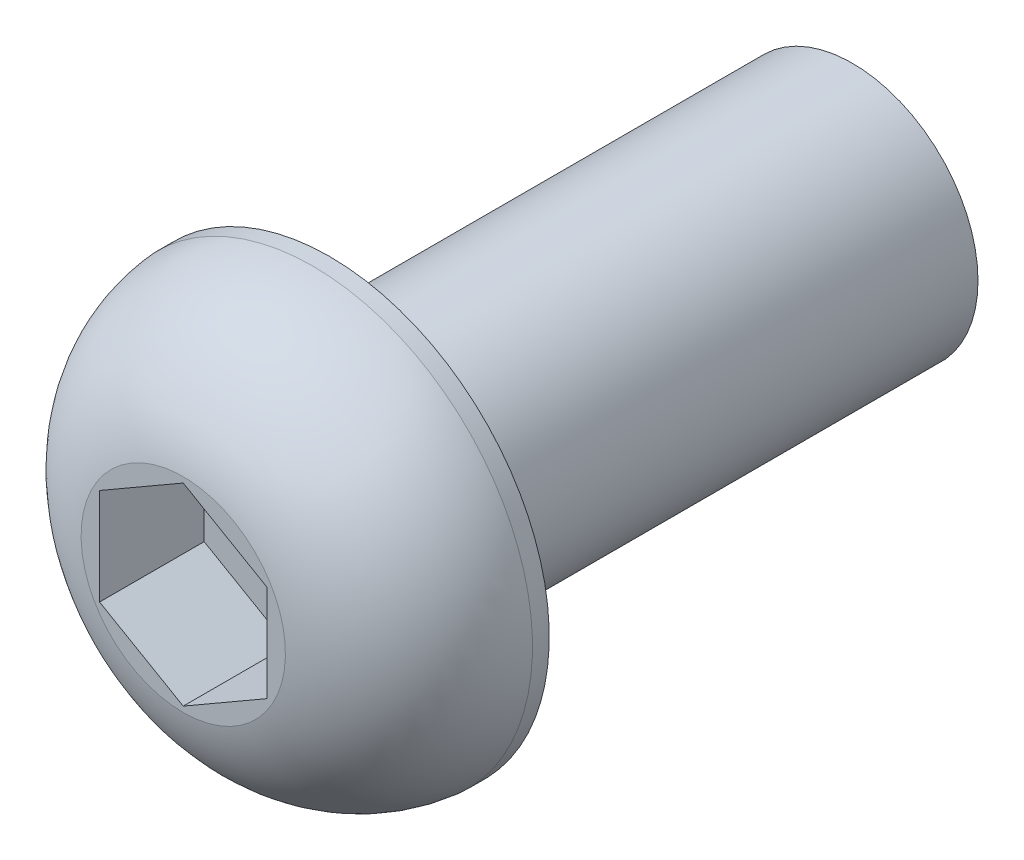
ISO-10303-21;
HEADER;
FILE_DESCRIPTION(('STEP AP214'),'2;1');
FILE_NAME('part.step','',(''),(''),'','','');
FILE_SCHEMA(('AUTOMOTIVE_DESIGN { 1 0 10303 214 1 1 1 1 }'));
ENDSEC;
DATA;
#1=APPLICATION_CONTEXT('core data for automotive mechanical design processes');
#2=APPLICATION_PROTOCOL_DEFINITION('international standard','automotive_design',2000,#1);
#3=PRODUCT_CONTEXT('',#1,'mechanical');
#4=PRODUCT('Part','Part','',(#3));
#5=PRODUCT_RELATED_PRODUCT_CATEGORY('part','',(#4));
#6=PRODUCT_DEFINITION_FORMATION('','',#4);
#7=PRODUCT_DEFINITION_CONTEXT('part definition',#1,'design');
#8=PRODUCT_DEFINITION('design','',#6,#7);
#9=PRODUCT_DEFINITION_SHAPE('','',#8);
#10=(LENGTH_UNIT() NAMED_UNIT(*) SI_UNIT(.MILLI.,.METRE.));
#11=(NAMED_UNIT(*) PLANE_ANGLE_UNIT() SI_UNIT($,.RADIAN.));
#12=(NAMED_UNIT(*) SI_UNIT($,.STERADIAN.) SOLID_ANGLE_UNIT());
#13=UNCERTAINTY_MEASURE_WITH_UNIT(LENGTH_MEASURE(1.E-05),#10,'distance_accuracy_value','');
#14=(GEOMETRIC_REPRESENTATION_CONTEXT(3) GLOBAL_UNCERTAINTY_ASSIGNED_CONTEXT((#13)) GLOBAL_UNIT_ASSIGNED_CONTEXT((#10,
#11,#12)) REPRESENTATION_CONTEXT('',''));
#15=CARTESIAN_POINT('',(0.,0.,0.));
#16=DIRECTION('',(0.,0.,1.));
#17=DIRECTION('',(1.,0.,0.));
#18=AXIS2_PLACEMENT_3D('',#15,#16,#17);
#19=CARTESIAN_POINT('',(0.,0.,7.));
#20=DIRECTION('',(0.,0.,1.));
#21=DIRECTION('',(0.,-1.,0.));
#22=AXIS2_PLACEMENT_3D('',#19,#20,#21);
#23=PLANE('',#22);
#24=CARTESIAN_POINT('',(0.,0.,7.));
#25=DIRECTION('',(0.,0.,1.));
#26=DIRECTION('',(0.,-1.,0.));
#27=AXIS2_PLACEMENT_3D('',#24,#25,#26);
#28=CIRCLE('',#27,4.88468858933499);
#29=CARTESIAN_POINT('',(0.,-4.88468858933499,7.));
#30=VERTEX_POINT('',#29);
#31=EDGE_CURVE('E72',#30,#30,#28,.T.);
#32=ORIENTED_EDGE('',*,*,#31,.T.);
#33=EDGE_LOOP('',(#32));
#34=FACE_BOUND('',#33,.T.);
#35=DIRECTION('',(0.,-1.,0.));
#36=VECTOR('',#35,1.);
#37=CARTESIAN_POINT('',(4.,2.30940107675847,7.));
#38=LINE('',#37,#36);
#39=CARTESIAN_POINT('',(4.,2.30940107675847,7.));
#40=VERTEX_POINT('',#39);
#41=CARTESIAN_POINT('',(4.,-2.30940107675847,7.));
#42=VERTEX_POINT('',#41);
#43=EDGE_CURVE('E86',#40,#42,#38,.T.);
#44=ORIENTED_EDGE('',*,*,#43,.T.);
#45=DIRECTION('',(-0.86602540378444,-0.5,0.));
#46=VECTOR('',#45,1.);
#47=CARTESIAN_POINT('',(4.,-2.30940107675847,7.));
#48=LINE('',#47,#46);
#49=CARTESIAN_POINT('',(0.,-4.61880215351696,7.));
#50=VERTEX_POINT('',#49);
#51=EDGE_CURVE('E31',#42,#50,#48,.T.);
#52=ORIENTED_EDGE('',*,*,#51,.T.);
#53=DIRECTION('',(0.86602540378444,-0.5,0.));
#54=VECTOR('',#53,1.);
#55=CARTESIAN_POINT('',(-4.,-2.30940107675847,7.));
#56=LINE('',#55,#54);
#57=CARTESIAN_POINT('',(-4.,-2.30940107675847,7.));
#58=VERTEX_POINT('',#57);
#59=EDGE_CURVE('E76',#58,#50,#56,.T.);
#60=ORIENTED_EDGE('',*,*,#59,.F.);
#61=DIRECTION('',(0.,-1.,0.));
#62=VECTOR('',#61,1.);
#63=CARTESIAN_POINT('',(-4.,2.30940107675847,7.));
#64=LINE('',#63,#62);
#65=CARTESIAN_POINT('',(-4.,2.30940107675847,7.));
#66=VERTEX_POINT('',#65);
#67=EDGE_CURVE('E81',#66,#58,#64,.T.);
#68=ORIENTED_EDGE('',*,*,#67,.F.);
#69=DIRECTION('',(0.86602540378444,0.5,0.));
#70=VECTOR('',#69,1.);
#71=CARTESIAN_POINT('',(-4.,2.30940107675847,7.));
#72=LINE('',#71,#70);
#73=CARTESIAN_POINT('',(0.,4.61880215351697,7.));
#74=VERTEX_POINT('',#73);
#75=EDGE_CURVE('E93',#66,#74,#72,.T.);
#76=ORIENTED_EDGE('',*,*,#75,.T.);
#77=DIRECTION('',(-0.86602540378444,0.5,0.));
#78=VECTOR('',#77,1.);
#79=CARTESIAN_POINT('',(4.,2.30940107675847,7.));
#80=LINE('',#79,#78);
#81=EDGE_CURVE('E96',#40,#74,#80,.T.);
#82=ORIENTED_EDGE('',*,*,#81,.F.);
#83=EDGE_LOOP('',(#44,#52,#60,#68,#76,#82));
#84=FACE_BOUND('',#83,.T.);
#85=ADVANCED_FACE('F16',(#34,#84),#23,.T.);
#86=CARTESIAN_POINT('',(0.,0.,15.));
#87=DIRECTION('',(0.,0.,1.));
#88=DIRECTION('',(0.,-1.,0.));
#89=AXIS2_PLACEMENT_3D('',#86,#87,#88);
#90=CYLINDRICAL_SURFACE('',#89,6.);
#91=CARTESIAN_POINT('',(0.,0.,0.));
#92=DIRECTION('',(0.,0.,1.));
#93=DIRECTION('',(0.,-1.,0.));
#94=AXIS2_PLACEMENT_3D('',#91,#92,#93);
#95=CIRCLE('',#94,6.);
#96=CARTESIAN_POINT('',(0.,-6.,0.));
#97=VERTEX_POINT('',#96);
#98=EDGE_CURVE('E11',#97,#97,#95,.T.);
#99=ORIENTED_EDGE('',*,*,#98,.F.);
#100=EDGE_LOOP('',(#99));
#101=FACE_BOUND('',#100,.T.);
#102=CARTESIAN_POINT('',(0.,0.,-25.));
#103=DIRECTION('',(0.,0.,1.));
#104=DIRECTION('',(1.,0.,0.));
#105=AXIS2_PLACEMENT_3D('',#102,#103,#104);
#106=CIRCLE('',#105,6.);
#107=CARTESIAN_POINT('',(6.,0.,-25.));
#108=VERTEX_POINT('',#107);
#109=EDGE_CURVE('E87',#108,#108,#106,.T.);
#110=ORIENTED_EDGE('',*,*,#109,.T.);
#111=EDGE_LOOP('',(#110));
#112=FACE_BOUND('',#111,.T.);
#113=ADVANCED_FACE('F136',(#101,#112),#90,.T.);
#114=CARTESIAN_POINT('',(0.,6.,0.));
#115=DIRECTION('',(0.,0.,1.));
#116=DIRECTION('',(0.,-1.,0.));
#117=AXIS2_PLACEMENT_3D('',#114,#115,#116);
#118=PLANE('',#117);
#119=CARTESIAN_POINT('',(0.,0.,0.));
#120=DIRECTION('',(0.,0.,1.));
#121=DIRECTION('',(0.,-1.,0.));
#122=AXIS2_PLACEMENT_3D('',#119,#120,#121);
#123=CIRCLE('',#122,10.4999999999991);
#124=CARTESIAN_POINT('',(0.,-10.4999999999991,0.));
#125=VERTEX_POINT('',#124);
#126=EDGE_CURVE('E24',#125,#125,#123,.T.);
#127=ORIENTED_EDGE('',*,*,#126,.F.);
#128=EDGE_LOOP('',(#127));
#129=FACE_BOUND('',#128,.T.);
#130=ORIENTED_EDGE('',*,*,#98,.T.);
#131=EDGE_LOOP('',(#130));
#132=FACE_BOUND('',#131,.T.);
#133=ADVANCED_FACE('F133',(#129,#132),#118,.F.);
#134=CARTESIAN_POINT('',(0.,0.,15.));
#135=DIRECTION('',(0.,0.,1.));
#136=DIRECTION('',(0.,-1.,0.));
#137=AXIS2_PLACEMENT_3D('',#134,#135,#136);
#138=CYLINDRICAL_SURFACE('',#137,10.4999999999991);
#139=ORIENTED_EDGE('',*,*,#126,.T.);
#140=EDGE_LOOP('',(#139));
#141=FACE_BOUND('',#140,.T.);
#142=CARTESIAN_POINT('',(0.,0.,0.799999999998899));
#143=DIRECTION('',(0.,0.,1.));
#144=DIRECTION('',(0.,-1.,0.));
#145=AXIS2_PLACEMENT_3D('',#142,#143,#144);
#146=CIRCLE('',#145,10.4999999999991);
#147=CARTESIAN_POINT('',(0.,-10.4999999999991,0.7999999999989));
#148=VERTEX_POINT('',#147);
#149=EDGE_CURVE('E125',#148,#148,#146,.T.);
#150=ORIENTED_EDGE('',*,*,#149,.F.);
#151=EDGE_LOOP('',(#150));
#152=FACE_BOUND('',#151,.T.);
#153=ADVANCED_FACE('F130',(#141,#152),#138,.T.);
#154=CARTESIAN_POINT('',(0.,0.,0.131950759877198));
#155=DIRECTION('',(0.,0.,1.));
#156=DIRECTION('',(0.,-1.,0.));
#157=AXIS2_PLACEMENT_3D('',#154,#155,#156);
#158=DEGENERATE_TOROIDAL_SURFACE('',#157,3.5319507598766,6.99999999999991,.T.);
#159=ORIENTED_EDGE('',*,*,#31,.F.);
#160=EDGE_LOOP('',(#159));
#161=FACE_BOUND('',#160,.T.);
#162=ORIENTED_EDGE('',*,*,#149,.T.);
#163=EDGE_LOOP('',(#162));
#164=FACE_BOUND('',#163,.T.);
#165=ADVANCED_FACE('F167',(#161,#164),#158,.T.);
#166=CARTESIAN_POINT('',(4.,-2.30940107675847,2.));
#167=DIRECTION('',(-0.5,0.86602540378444,0.));
#168=DIRECTION('',(-0.86602540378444,-0.5,0.));
#169=AXIS2_PLACEMENT_3D('',#166,#167,#168);
#170=PLANE('',#169);
#171=DIRECTION('',(0.,0.,1.));
#172=VECTOR('',#171,1.);
#173=CARTESIAN_POINT('',(0.,-4.61880215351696,2.));
#174=LINE('',#173,#172);
#175=CARTESIAN_POINT('',(0.,-4.61880215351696,2.));
#176=VERTEX_POINT('',#175);
#177=EDGE_CURVE('E65',#176,#50,#174,.T.);
#178=ORIENTED_EDGE('',*,*,#177,.T.);
#179=ORIENTED_EDGE('',*,*,#51,.F.);
#180=DIRECTION('',(0.,0.,1.));
#181=VECTOR('',#180,1.);
#182=CARTESIAN_POINT('',(4.,-2.30940107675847,2.));
#183=LINE('',#182,#181);
#184=CARTESIAN_POINT('',(4.,-2.30940107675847,2.));
#185=VERTEX_POINT('',#184);
#186=EDGE_CURVE('E35',#185,#42,#183,.T.);
#187=ORIENTED_EDGE('',*,*,#186,.F.);
#188=DIRECTION('',(-0.86602540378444,-0.5,0.));
#189=VECTOR('',#188,1.);
#190=CARTESIAN_POINT('',(4.,-2.30940107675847,2.));
#191=LINE('',#190,#189);
#192=EDGE_CURVE('E68',#185,#176,#191,.T.);
#193=ORIENTED_EDGE('',*,*,#192,.T.);
#194=EDGE_LOOP('',(#178,#179,#187,#193));
#195=FACE_BOUND('',#194,.T.);
#196=ADVANCED_FACE('F67',(#195),#170,.T.);
#197=CARTESIAN_POINT('',(-4.,-2.30940107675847,2.));
#198=DIRECTION('',(-0.5,-0.86602540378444,0.));
#199=DIRECTION('',(0.86602540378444,-0.5,0.));
#200=AXIS2_PLACEMENT_3D('',#197,#198,#199);
#201=PLANE('',#200);
#202=DIRECTION('',(0.,0.,1.));
#203=VECTOR('',#202,1.);
#204=CARTESIAN_POINT('',(-4.,-2.30940107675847,2.));
#205=LINE('',#204,#203);
#206=CARTESIAN_POINT('',(-4.,-2.30940107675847,2.));
#207=VERTEX_POINT('',#206);
#208=EDGE_CURVE('E73',#207,#58,#205,.T.);
#209=ORIENTED_EDGE('',*,*,#208,.T.);
#210=ORIENTED_EDGE('',*,*,#59,.T.);
#211=ORIENTED_EDGE('',*,*,#177,.F.);
#212=DIRECTION('',(0.86602540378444,-0.5,0.));
#213=VECTOR('',#212,1.);
#214=CARTESIAN_POINT('',(-4.,-2.30940107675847,2.));
#215=LINE('',#214,#213);
#216=EDGE_CURVE('E101',#207,#176,#215,.T.);
#217=ORIENTED_EDGE('',*,*,#216,.F.);
#218=EDGE_LOOP('',(#209,#210,#211,#217));
#219=FACE_BOUND('',#218,.T.);
#220=ADVANCED_FACE('F77',(#219),#201,.F.);
#221=CARTESIAN_POINT('',(-4.,2.30940107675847,2.));
#222=DIRECTION('',(-1.,0.,0.));
#223=DIRECTION('',(0.,-1.,0.));
#224=AXIS2_PLACEMENT_3D('',#221,#222,#223);
#225=PLANE('',#224);
#226=DIRECTION('',(0.,0.,1.));
#227=VECTOR('',#226,1.);
#228=CARTESIAN_POINT('',(-4.,2.30940107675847,2.));
#229=LINE('',#228,#227);
#230=CARTESIAN_POINT('',(-4.,2.30940107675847,2.));
#231=VERTEX_POINT('',#230);
#232=EDGE_CURVE('E120',#231,#66,#229,.T.);
#233=ORIENTED_EDGE('',*,*,#232,.T.);
#234=ORIENTED_EDGE('',*,*,#67,.T.);
#235=ORIENTED_EDGE('',*,*,#208,.F.);
#236=DIRECTION('',(0.,-1.,0.));
#237=VECTOR('',#236,1.);
#238=CARTESIAN_POINT('',(-4.,2.30940107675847,2.));
#239=LINE('',#238,#237);
#240=EDGE_CURVE('E103',#231,#207,#239,.T.);
#241=ORIENTED_EDGE('',*,*,#240,.F.);
#242=EDGE_LOOP('',(#233,#234,#235,#241));
#243=FACE_BOUND('',#242,.T.);
#244=ADVANCED_FACE('F200',(#243),#225,.F.);
#245=CARTESIAN_POINT('',(-4.,2.30940107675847,2.));
#246=DIRECTION('',(0.5,-0.86602540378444,0.));
#247=DIRECTION('',(0.86602540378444,0.5,0.));
#248=AXIS2_PLACEMENT_3D('',#245,#246,#247);
#249=PLANE('',#248);
#250=DIRECTION('',(0.,0.,1.));
#251=VECTOR('',#250,1.);
#252=CARTESIAN_POINT('',(0.,4.61880215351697,2.));
#253=LINE('',#252,#251);
#254=CARTESIAN_POINT('',(0.,4.61880215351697,2.));
#255=VERTEX_POINT('',#254);
#256=EDGE_CURVE('E118',#255,#74,#253,.T.);
#257=ORIENTED_EDGE('',*,*,#256,.T.);
#258=ORIENTED_EDGE('',*,*,#75,.F.);
#259=ORIENTED_EDGE('',*,*,#232,.F.);
#260=DIRECTION('',(0.86602540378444,0.5,0.));
#261=VECTOR('',#260,1.);
#262=CARTESIAN_POINT('',(-4.,2.30940107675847,2.));
#263=LINE('',#262,#261);
#264=EDGE_CURVE('E106',#231,#255,#263,.T.);
#265=ORIENTED_EDGE('',*,*,#264,.T.);
#266=EDGE_LOOP('',(#257,#258,#259,#265));
#267=FACE_BOUND('',#266,.T.);
#268=ADVANCED_FACE('F207',(#267),#249,.T.);
#269=CARTESIAN_POINT('',(4.,2.30940107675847,2.));
#270=DIRECTION('',(0.5,0.86602540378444,0.));
#271=DIRECTION('',(-0.86602540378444,0.5,0.));
#272=AXIS2_PLACEMENT_3D('',#269,#270,#271);
#273=PLANE('',#272);
#274=DIRECTION('',(0.,0.,1.));
#275=VECTOR('',#274,1.);
#276=CARTESIAN_POINT('',(4.,2.30940107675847,2.));
#277=LINE('',#276,#275);
#278=CARTESIAN_POINT('',(4.,2.30940107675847,2.));
#279=VERTEX_POINT('',#278);
#280=EDGE_CURVE('E116',#279,#40,#277,.T.);
#281=ORIENTED_EDGE('',*,*,#280,.T.);
#282=ORIENTED_EDGE('',*,*,#81,.T.);
#283=ORIENTED_EDGE('',*,*,#256,.F.);
#284=DIRECTION('',(-0.86602540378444,0.5,0.));
#285=VECTOR('',#284,1.);
#286=CARTESIAN_POINT('',(4.,2.30940107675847,2.));
#287=LINE('',#286,#285);
#288=EDGE_CURVE('E109',#279,#255,#287,.T.);
#289=ORIENTED_EDGE('',*,*,#288,.F.);
#290=EDGE_LOOP('',(#281,#282,#283,#289));
#291=FACE_BOUND('',#290,.T.);
#292=ADVANCED_FACE('F154',(#291),#273,.F.);
#293=CARTESIAN_POINT('',(4.,2.30940107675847,2.));
#294=DIRECTION('',(-1.,0.,0.));
#295=DIRECTION('',(0.,-1.,0.));
#296=AXIS2_PLACEMENT_3D('',#293,#294,#295);
#297=PLANE('',#296);
#298=DIRECTION('',(0.,-1.,0.));
#299=VECTOR('',#298,1.);
#300=CARTESIAN_POINT('',(4.,2.30940107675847,2.));
#301=LINE('',#300,#299);
#302=EDGE_CURVE('E112',#279,#185,#301,.T.);
#303=ORIENTED_EDGE('',*,*,#302,.T.);
#304=ORIENTED_EDGE('',*,*,#186,.T.);
#305=ORIENTED_EDGE('',*,*,#43,.F.);
#306=ORIENTED_EDGE('',*,*,#280,.F.);
#307=EDGE_LOOP('',(#303,#304,#305,#306));
#308=FACE_BOUND('',#307,.T.);
#309=ADVANCED_FACE('F146',(#308),#297,.T.);
#310=CARTESIAN_POINT('',(-4.,-6.92820323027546,2.));
#311=DIRECTION('',(0.,0.,1.));
#312=DIRECTION('',(1.,0.,0.));
#313=AXIS2_PLACEMENT_3D('',#310,#311,#312);
#314=PLANE('',#313);
#315=ORIENTED_EDGE('',*,*,#192,.F.);
#316=ORIENTED_EDGE('',*,*,#302,.F.);
#317=ORIENTED_EDGE('',*,*,#288,.T.);
#318=ORIENTED_EDGE('',*,*,#264,.F.);
#319=ORIENTED_EDGE('',*,*,#240,.T.);
#320=ORIENTED_EDGE('',*,*,#216,.T.);
#321=EDGE_LOOP('',(#315,#316,#317,#318,#319,#320));
#322=FACE_BOUND('',#321,.T.);
#323=ADVANCED_FACE('F145',(#322),#314,.T.);
#324=CARTESIAN_POINT('',(0.,4.00000000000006,-25.));
#325=DIRECTION('',(0.,0.,-1.));
#326=DIRECTION('',(0.,1.,0.));
#327=AXIS2_PLACEMENT_3D('',#324,#325,#326);
#328=PLANE('',#327);
#329=ORIENTED_EDGE('',*,*,#109,.F.);
#330=EDGE_LOOP('',(#329));
#331=FACE_BOUND('',#330,.T.);
#332=ADVANCED_FACE('F18',(#331),#328,.T.);
#333=CLOSED_SHELL('',(#85,#113,#133,#153,#165,#196,#220,#244,#268,#292,#309,#323,#332));
#334=MANIFOLD_SOLID_BREP('B1',#333);
#335=ADVANCED_BREP_SHAPE_REPRESENTATION('',(#18,#334),#14);
#336=SHAPE_DEFINITION_REPRESENTATION(#9,#335);
ENDSEC;
END-ISO-10303-21;
